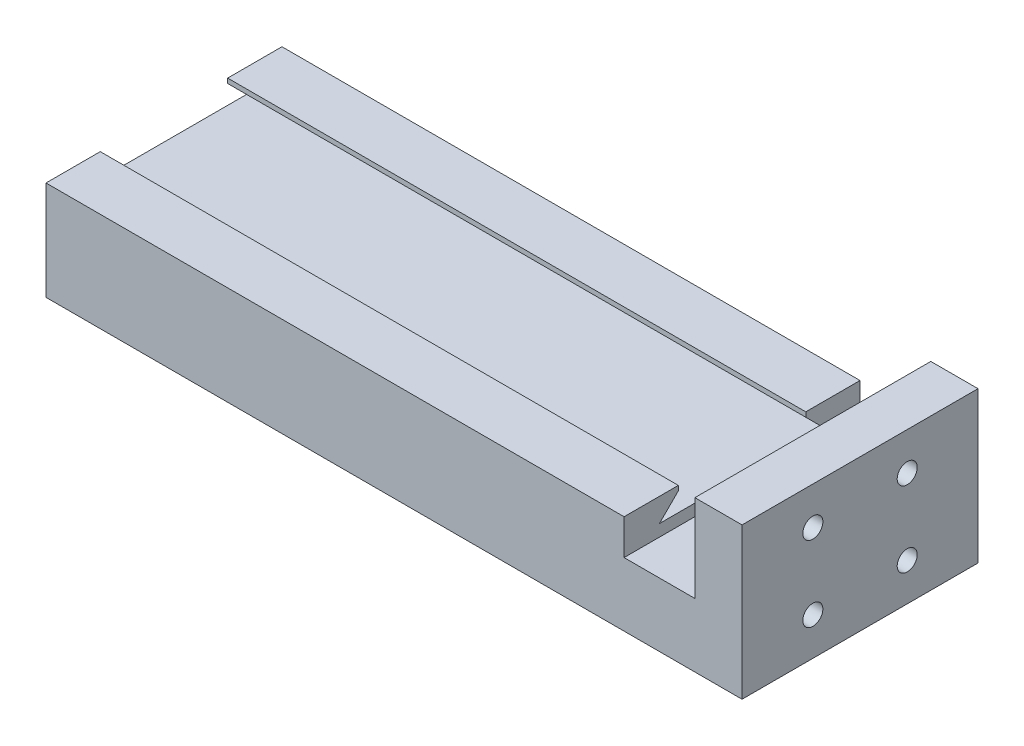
from build123d import *

# Parameters (mm, degrees)
BOSS_EXTRUDE1_DEPTH        = 50
CUT_EXTRUDE1_DEPTH         = 245
M10X1_5_TAPPED_HOLE1_D     = 8.5
M10X1_5_TAPPED_HOLE1_DEPTH = 24.5
M10X1_5_TAPPED_HOLE1_TIP   = 2.553657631


with BuildPart() as part:
    # Sketch1 → Boss-Extrude1 (new, symmetric)
    with BuildSketch(Plane.XY):
        Polygon((-147.5, 0), (147.5, 0), (147.5, 64), (127.5, 64), (127.5, 27), (97.5, 27), (97.5, 42), (-147.5, 42), align=None)
    extrude(amount=BOSS_EXTRUDE1_DEPTH, both=True)

    # Sketch2 → Cut-Extrude1 (cut)
    with BuildSketch(Plane.ZY.offset(147.5)):
        Polygon((-50, 42), (-27, 42), (-27, 40), (-35, 32), (35, 32), (27, 40), (27, 42), (50, 42), (50, 52), (-50, 52), align=None)
    extrude(amount=-CUT_EXTRUDE1_DEPTH, mode=Mode.SUBTRACT)

    # M10x1.5 Tapped Hole1
    with Locations(Plane(origin=(147.5, 0, 0), x_dir=(0, 0, -1), z_dir=(1, 0, 0))):
        with Locations((-20, 48), (20, 48), (20, 16), (-20, 16)):
            Hole(M10X1_5_TAPPED_HOLE1_D / 2, depth=M10X1_5_TAPPED_HOLE1_DEPTH)
            with Locations((0, 0, -(M10X1_5_TAPPED_HOLE1_DEPTH + M10X1_5_TAPPED_HOLE1_TIP / 2))):  # 118° drill point
                Cone(0, M10X1_5_TAPPED_HOLE1_D / 2, M10X1_5_TAPPED_HOLE1_TIP, mode=Mode.SUBTRACT)


solid = part.part
